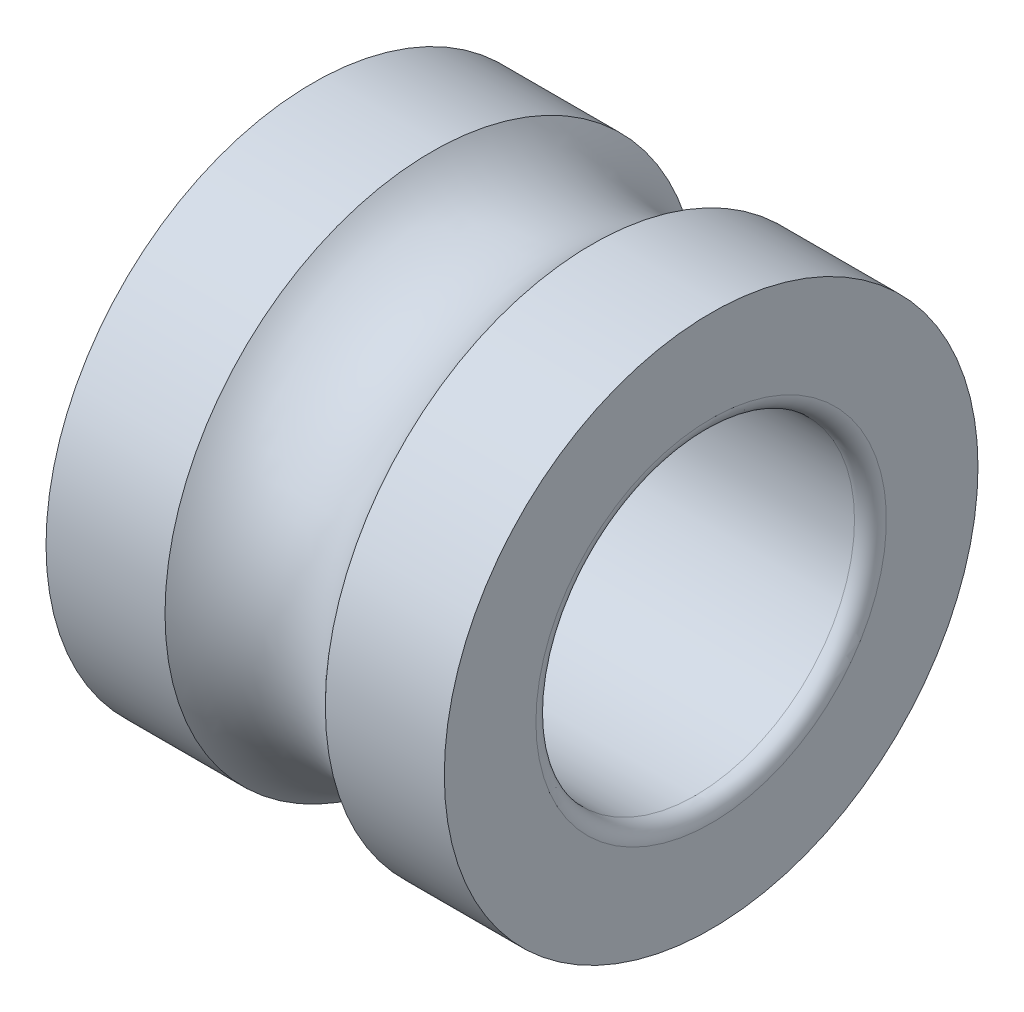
from build123d import *


with BuildPart() as part:
    # Esquisse1 → Base-R_volution (revolve)
    with BuildSketch(Plane(origin=(0, 0, 0), x_dir=(1, 0, 0), z_dir=(0, 1, 0)), mode=Mode.PRIVATE) as base_r_volution_sk:
        with BuildLine():
            Line((0, 3.35), (0, 2.2))
            ThreePointArc((0, 2.2), (0.058578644, 2.058578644), (0.2, 2))
            Line((0.2, 2), (4.8, 2))
            ThreePointArc((4.8, 2), (4.941421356, 2.058578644), (5, 2.2))
            Line((5, 2.2), (5, 3.35))
            Line((5, 3.35), (3.50623059, 3.35))
            ThreePointArc((3.50623059, 3.35), (2.5, 2.9), (1.49376941, 3.35))
            Line((1.49376941, 3.35), (0, 3.35))
        make_face()
    revolve(base_r_volution_sk.sketch.rotate(Axis((0, 0, 0), (1, 0, 0)), 180), axis=Axis((0, 0, 0), (1, 0, 0)))


solid = part.part
